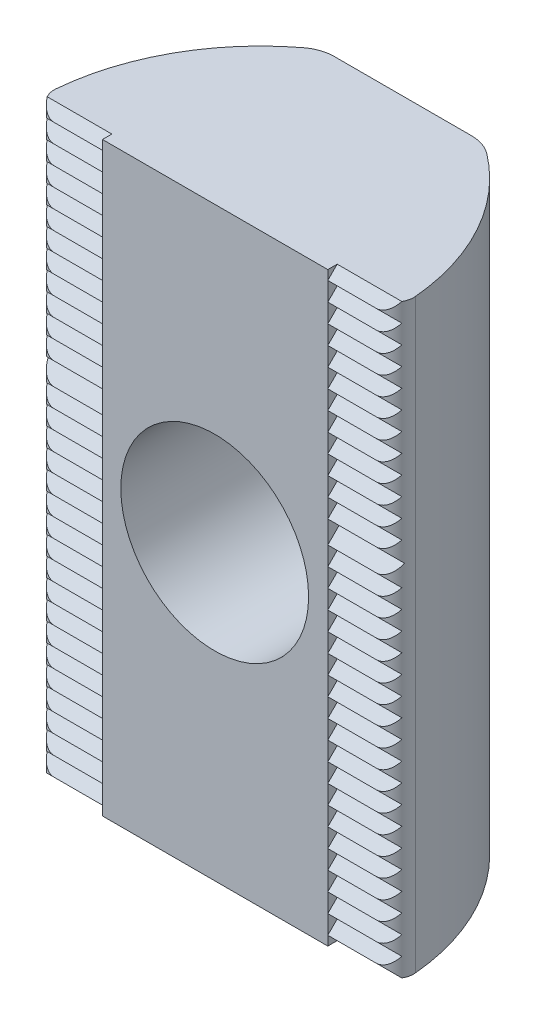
from build123d import *

# Parameters (mm, degrees)
EXTRUDE_1_DEPTH     = 7.8
M6X1_0_1_D          = 5
CUT_EXTRUDE_2_DEPTH = 13.103698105
CUT_EXTRUDE_3_DEPTH = 13.103698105


with BuildPart() as part:
    # Sketch 1 → Extrude 1 (new, symmetric)
    with BuildSketch(Plane.XZ):
        with BuildLine():
            Line((-4.28842123, 0), (4.28842123, 0))
            ThreePointArc((4.28842123, 0), (4.657211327, -0.162370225), (4.786479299, -0.54402454))
            ThreePointArc((4.786479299, -0.54402454), (4.060490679, -2.919187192), (2.434814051, -4.796853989))
            ThreePointArc((2.434814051, -4.796853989), (2.149347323, -4.947853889), (1.830642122, -5))
            Line((1.830642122, -5), (-1.830642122, -5))
            ThreePointArc((-1.830642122, -5), (-2.149347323, -4.947853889), (-2.434814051, -4.796853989))
            ThreePointArc((-2.434814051, -4.796853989), (-4.060490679, -2.919187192), (-4.786479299, -0.54402454))
            ThreePointArc((-4.786479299, -0.54402454), (-4.657211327, -0.162370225), (-4.28842123, 0))
        make_face()
    extrude(amount=EXTRUDE_1_DEPTH, both=True)

    # M6x1.0 _1 (through all)
    with Locations(Plane(origin=(1.337388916, 5.214464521, 0), x_dir=(1, 0, 0), z_dir=(0, 0, 1))):
        with Locations((-1.348967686, -5.214464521)):
            Hole(M6X1_0_1_D / 2)

    # Sketch 4 → Cut-Extrude 2 (cut, through all)
    with BuildSketch(Plane(origin=(3, 0, 0), x_dir=(0, 0, -1), z_dir=(1, 0, 0))):
        Polygon((0.25, -7.8), (-2.012448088, -7.8), (-2.012448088, 7.8), (0.25, 7.8), (0, 7.55), (0.25, 7.3), (0, 7.05), (0.25, 6.8), (0, 6.55), (0.25, 6.3), (0, 6.05), (0.25, 5.8), (0, 5.55), (0.25, 5.3), (0, 5.05), (0.25, 4.8), (0, 4.55), (0.25, 4.3), (0, 4.05), (0.25, 3.8), (0, 3.55), (0.25, 3.3), (0, 3.05), (0.25, 2.8), (0, 2.55), (0.25, 2.3), (0, 2.05), (0.3, 1.75), (0, 1.45), (0.25, 1.2), (0, 0.95), (0.25, 0.7), (0, 0.45), (0.25, 0.2), (0, -0.05), (0.25, -0.3), (0, -0.55), (0.25, -0.8), (0, -1.05), (0.25, -1.3), (0, -1.55), (0.25, -1.8), (0, -2.05), (0.25, -2.3), (0, -2.55), (0.25, -2.8), (0, -3.05), (0.25, -3.3), (0, -3.55), (0.25, -3.8), (0, -4.05), (0.25, -4.3), (0, -4.55), (0.25, -4.8), (0, -5.05), (0.25, -5.3), (0, -5.55), (0.25, -5.8), (0, -6.05), (0.25, -6.3), (0, -6.55), (0.25, -6.8), (0, -7.05), (0.25, -7.3), (0, -7.55), align=None)
    extrude(amount=CUT_EXTRUDE_2_DEPTH, mode=Mode.SUBTRACT)

    # Sketch 5 → Cut-Extrude 3 (cut, through all)
    with BuildSketch(Plane(origin=(-3, 0, 0), x_dir=(0, 0, -1), z_dir=(1, 0, 0))):
        Polygon((-2.012448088, 7.8), (0.25, 7.8), (0, 7.55), (0.25, 7.3), (0, 7.05), (0.25, 6.8), (0, 6.55), (0.25, 6.3), (0, 6.05), (0.25, 5.8), (0, 5.55), (0.25, 5.3), (0, 5.05), (0.25, 4.8), (0, 4.55), (0.25, 4.3), (0, 4.05), (0.25, 3.8), (0, 3.55), (0.25, 3.3), (0, 3.05), (0.25, 2.8), (0, 2.55), (0.25, 2.3), (0, 2.05), (0.3, 1.75), (0, 1.45), (0.25, 1.2), (0, 0.95), (0.25, 0.7), (0, 0.45), (0.25, 0.2), (0, -0.05), (0.25, -0.3), (0, -0.55), (0.25, -0.8), (0, -1.05), (0.25, -1.3), (0, -1.55), (0.25, -1.8), (0, -2.05), (0.25, -2.3), (0, -2.55), (0.25, -2.8), (0, -3.05), (0.25, -3.3), (0, -3.55), (0.25, -3.8), (0, -4.05), (0.25, -4.3), (0, -4.55), (0.25, -4.8), (0, -5.05), (0.25, -5.3), (0, -5.55), (0.25, -5.8), (0, -6.05), (0.25, -6.3), (0, -6.55), (0.25, -6.8), (0, -7.05), (0.25, -7.3), (0, -7.55), (0.25, -7.8), (-2.012448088, -7.8), align=None)
    extrude(amount=-CUT_EXTRUDE_3_DEPTH, mode=Mode.SUBTRACT)


solid = part.part
